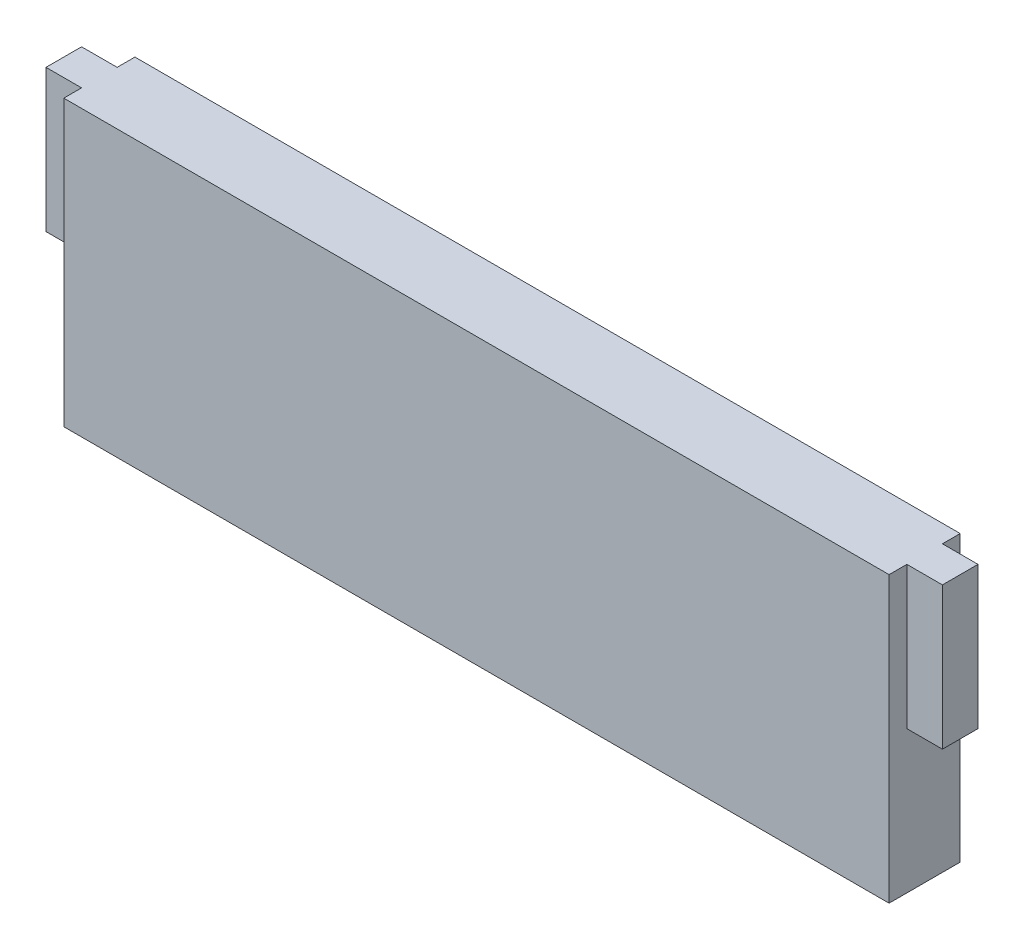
from build123d import *

# Parameters (mm, degrees)
BOSS_EXTRUDE1_DEPTH      = 2.5
BOSS_EXTRUDE1_DEPTH_BACK = 2.5
SKETCH2_W                = 58
SKETCH2_H                = 20
BOSS_EXTRUDE2_DEPTH      = 1.25
BOSS_EXTRUDE2_DEPTH_BACK = 1.25
SKETCH2_3_W              = 2.5
SKETCH2_3_H              = 10


with BuildPart() as part:
    # Sketch2 → Boss-Extrude1 (new, two sides: drawn at the far end of the back side and taken through both)
    with BuildSketch(Plane.XY.offset(-BOSS_EXTRUDE1_DEPTH_BACK)):
        with Locations((29, 20.212608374)):
            Rectangle(SKETCH2_W, SKETCH2_H)
    extrude(amount=BOSS_EXTRUDE1_DEPTH + BOSS_EXTRUDE1_DEPTH_BACK)

    # Sketch2_3 → Boss-Extrude2 (add, two sides: drawn at the far end of the back side and taken through both)
    with BuildSketch(Plane.XY.offset(-BOSS_EXTRUDE2_DEPTH_BACK)):
        with Locations((-1.25, 25.212608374)):
            Rectangle(SKETCH2_3_W, SKETCH2_3_H)
        with Locations((59.25, 25.212608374)):
            Rectangle(SKETCH2_3_W, SKETCH2_3_H)
    extrude(amount=BOSS_EXTRUDE2_DEPTH + BOSS_EXTRUDE2_DEPTH_BACK)


solid = part.part
